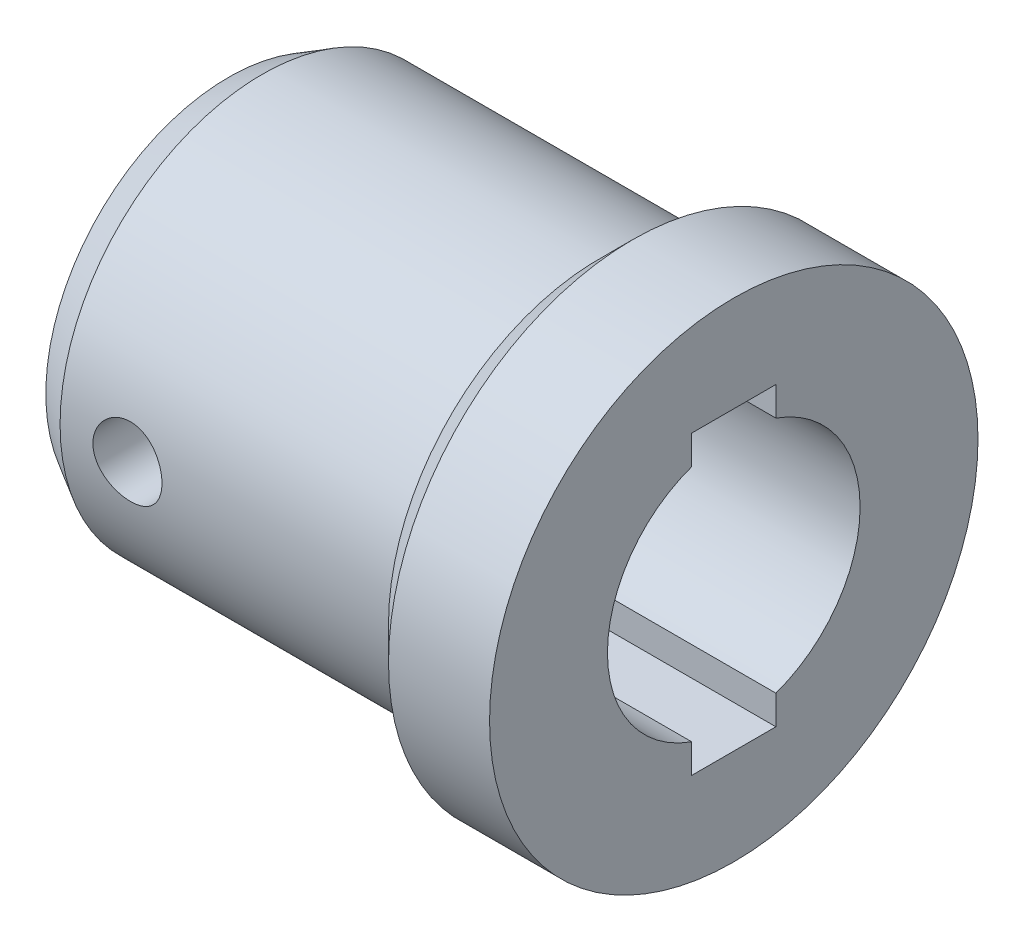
from build123d import *

# Parameters (mm, degrees)
CHANFREIN2_SIZE         = 0.5
CHANFREIN3_SIZE         = 2
CHANFREIN3_SIZE2        = 1.154700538
ENL_V_MAT_EXTRU_1_DEPTH = 9.8
CONG_1_R                = 3.5
CHANFREIN4_SIZE         = 2
ESQUISSE3_R             = 12.5
ENL_V_MAT_EXTRU_2_DEPTH = 55.319333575
ESQUISSE4_W             = 5
ESQUISSE4_H             = 1.728932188
ENL_V_MAT_EXTRU_3_DEPTH = 37.338684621
ESQUISSE5_R             = 2.05
ENL_V_MAT_EXTRU_4_DEPTH = 37.338684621


with BuildPart() as part:
    # Esquisse1 → R_volution1 (revolve)
    with BuildSketch(Plane.XY, mode=Mode.PRIVATE) as r_volution1_sk:
        Polygon((0, 7.5), (0, 12), (22, 12), (22, 14.5), (30, 14.5), (30, 12.5), (61.5, 12.5), (61.5, 11.5), (71.3, 11.5), (71.3, 9.4), (72.8, 9.4), (72.8, 10), (80.3, 10), (80.3, 7.5), align=None)
    revolve(r_volution1_sk.sketch.rotate(Axis((0, 0, 0), (1, 0, 0)), 90), axis=Axis((0, 0, 0), (1, 0, 0)))

    # Chanfrein2
    chanfrein2_edges = [part.edges().sort_by_distance(p)[0] for p in [
        (61.5, 0, -12.5),
    ]]
    chamfer(chanfrein2_edges, length=CHANFREIN2_SIZE)

    # Chanfrein3
    chanfrein3_edges = [part.edges().sort_by_distance(p)[0] for p in [
        (0, 0, -12),
    ]]
    chanfrein3_side = [part.faces().sort_by_distance(p)[0] for p in [
        (11, 0, -12),
    ]]
    chamfer(chanfrein3_edges, length=CHANFREIN3_SIZE, length2=CHANFREIN3_SIZE2, reference=chanfrein3_side[0])

    # Esquisse2 → Enl_v. mat.-Extru.1 (cut)
    with BuildSketch(Plane(origin=(71.3, 0, 0), x_dir=(0, 0, -1), z_dir=(1, 0, 0))):
        with BuildLine():
            Line((-5.31130869, 10.2), (5.31130869, 10.2))
            ThreePointArc((5.31130869, 10.2), (0, 11.5), (-5.31130869, 10.2))
        make_face()
        with BuildLine():
            Line((-5.31130869, -10.2), (5.31130869, -10.2))
            ThreePointArc((5.31130869, -10.2), (0, -11.5), (-5.31130869, -10.2))
        make_face()
    extrude(amount=-ENL_V_MAT_EXTRU_1_DEPTH, mode=Mode.SUBTRACT)

    # Cong_1
    cong_1_edges = [part.edges().sort_by_distance(p)[0] for p in [
        (66.4, -10.2, 5.31130869),
        (66.4, -10.2, -5.31130869),
        (66.4, 10.2, -5.31130869),
        (66.4, 10.2, 5.31130869),
    ]]
    fillet(cong_1_edges, radius=CONG_1_R)

    # Chanfrein4
    chanfrein4_edges = [part.edges().sort_by_distance(p)[0] for p in [
        (22, 0, -14.5),
    ]]
    chamfer(chanfrein4_edges, length=CHANFREIN4_SIZE)

    # Esquisse3 → Enl_v. mat.-Extru.2 (cut, through all)
    with BuildSketch(Plane(origin=(30, 0, 0), x_dir=(0, 0, -1), z_dir=(1, 0, 0))):
        Circle(ESQUISSE3_R)
    extrude(amount=ENL_V_MAT_EXTRU_2_DEPTH, mode=Mode.SUBTRACT)

    # Esquisse4 → Enl_v. mat.-Extru.3 (cut, through all)
    with BuildSketch(Plane(origin=(30, 0, 0), x_dir=(0, 0, -1), z_dir=(1, 0, 0))):
        with Locations((0, -7.935533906)):
            Rectangle(ESQUISSE4_W, ESQUISSE4_H)
        with Locations((0, 7.935533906)):
            Rectangle(ESQUISSE4_W, ESQUISSE4_H)
    extrude(amount=-ENL_V_MAT_EXTRU_3_DEPTH, mode=Mode.SUBTRACT)

    # Esquisse5 → Enl_v. mat.-Extru.4 (cut, through all)
    with BuildSketch(Plane.XY):
        with Locations((6, 0)):
            Circle(ESQUISSE5_R)
    extrude(amount=ENL_V_MAT_EXTRU_4_DEPTH, mode=Mode.SUBTRACT)


solid = part.part
